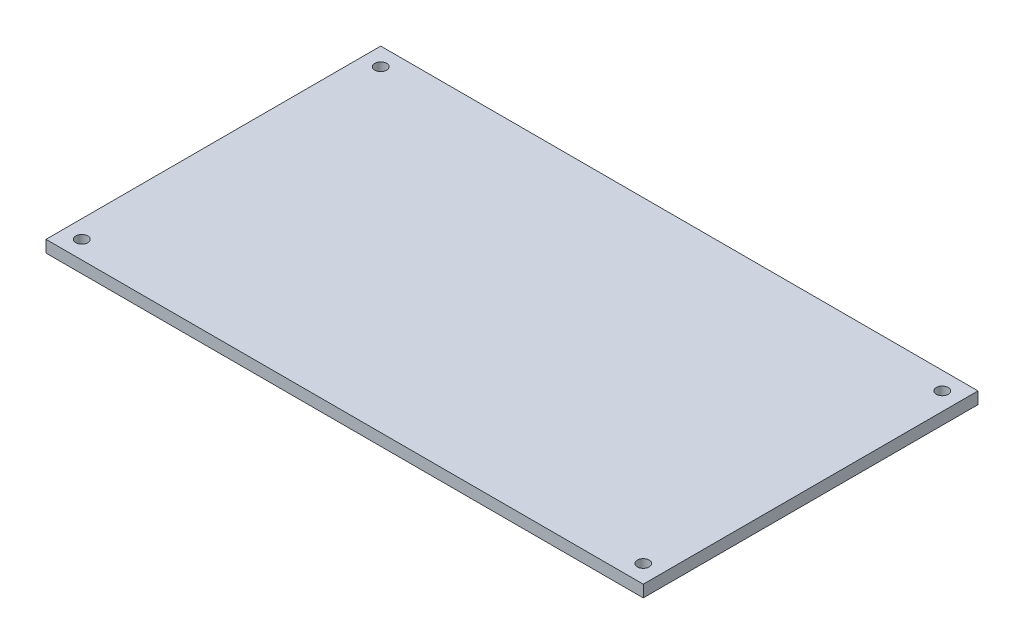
from build123d import *

# Parameters (mm, degrees)
SKETCH1_W           = 100.1
SKETCH1_H           = 56.1
SKETCH1_R           = 1
BOSS_EXTRUDE1_DEPTH = 2


with BuildPart() as part:
    # Sketch1 → Boss-Extrude1 (new body)
    with BuildSketch(Plane(origin=(0, 0, 0), x_dir=(1, 0, 0), z_dir=(0, 1, 0))):
        with Locations((50.05, 28.05)):
            Rectangle(SKETCH1_W, SKETCH1_H)
        with Locations(Location((3, 53.1, 0), (0, 0, 270))):
            Circle(SKETCH1_R, mode=Mode.SUBTRACT)
        with Locations(Location((97.1, 53.1, 0), (0, 0, 270))):
            Circle(SKETCH1_R, mode=Mode.SUBTRACT)
        with Locations(Location((97.1, 3, 0), (0, 0, 270))):
            Circle(SKETCH1_R, mode=Mode.SUBTRACT)
        with Locations(Location((3, 3, 0), (0, 0, 270))):
            Circle(SKETCH1_R, mode=Mode.SUBTRACT)
    extrude(amount=BOSS_EXTRUDE1_DEPTH)


solid = part.part
